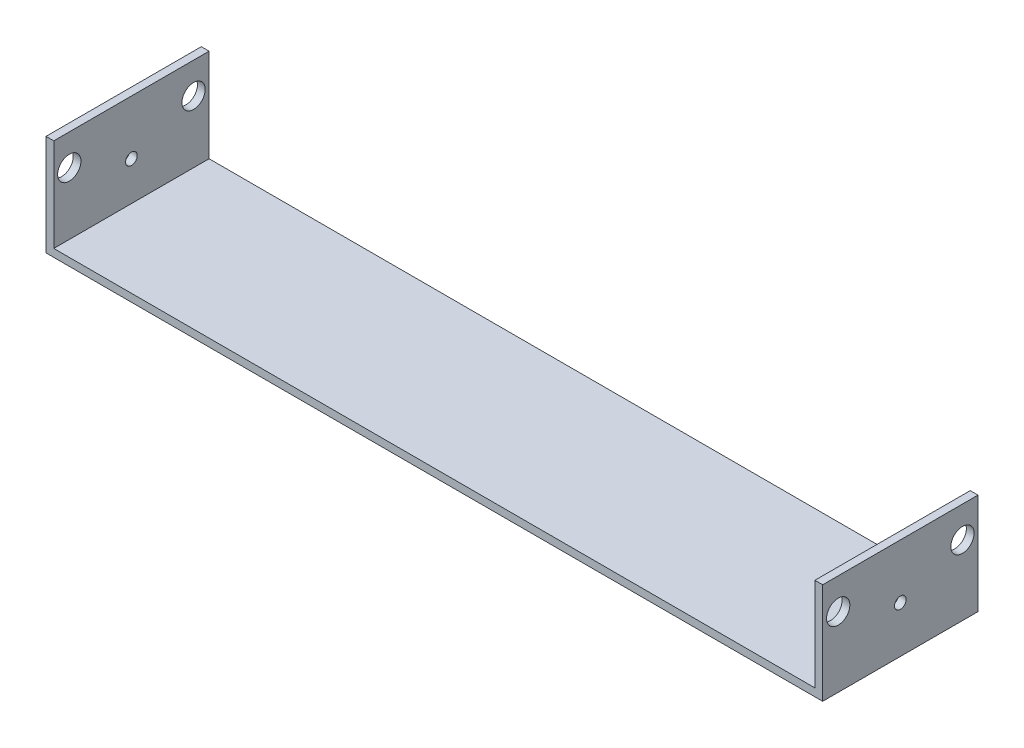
ISO-10303-21;
HEADER;
FILE_DESCRIPTION(('STEP AP214'),'2;1');
FILE_NAME('part.step','',(''),(''),'','','');
FILE_SCHEMA(('AUTOMOTIVE_DESIGN { 1 0 10303 214 1 1 1 1 }'));
ENDSEC;
DATA;
#1=APPLICATION_CONTEXT('core data for automotive mechanical design processes');
#2=APPLICATION_PROTOCOL_DEFINITION('international standard','automotive_design',2000,#1);
#3=PRODUCT_CONTEXT('',#1,'mechanical');
#4=PRODUCT('Part','Part','',(#3));
#5=PRODUCT_RELATED_PRODUCT_CATEGORY('part','',(#4));
#6=PRODUCT_DEFINITION_FORMATION('','',#4);
#7=PRODUCT_DEFINITION_CONTEXT('part definition',#1,'design');
#8=PRODUCT_DEFINITION('design','',#6,#7);
#9=PRODUCT_DEFINITION_SHAPE('','',#8);
#10=(LENGTH_UNIT() NAMED_UNIT(*) SI_UNIT(.MILLI.,.METRE.));
#11=(NAMED_UNIT(*) PLANE_ANGLE_UNIT() SI_UNIT($,.RADIAN.));
#12=(NAMED_UNIT(*) SI_UNIT($,.STERADIAN.) SOLID_ANGLE_UNIT());
#13=UNCERTAINTY_MEASURE_WITH_UNIT(LENGTH_MEASURE(1.E-05),#10,'distance_accuracy_value','');
#14=(GEOMETRIC_REPRESENTATION_CONTEXT(3) GLOBAL_UNCERTAINTY_ASSIGNED_CONTEXT((#13)) GLOBAL_UNIT_ASSIGNED_CONTEXT((#10,
#11,#12)) REPRESENTATION_CONTEXT('',''));
#15=CARTESIAN_POINT('',(0.,0.,0.));
#16=DIRECTION('',(0.,0.,1.));
#17=DIRECTION('',(1.,0.,0.));
#18=AXIS2_PLACEMENT_3D('',#15,#16,#17);
#19=CARTESIAN_POINT('',(-60.4331898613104,6.35,75.7878367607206));
#20=DIRECTION('',(0.,1.,0.));
#21=DIRECTION('',(0.,0.,1.));
#22=AXIS2_PLACEMENT_3D('',#19,#20,#21);
#23=PLANE('',#22);
#24=DIRECTION('',(-1.,0.,0.));
#25=VECTOR('',#24,1.);
#26=CARTESIAN_POINT('',(-60.4331898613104,6.35,-51.2121632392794));
#27=LINE('',#26,#25);
#28=CARTESIAN_POINT('',(568.216810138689,6.35,-51.2121632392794));
#29=VERTEX_POINT('',#28);
#30=CARTESIAN_POINT('',(-54.0831898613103,6.35,-51.2121632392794));
#31=VERTEX_POINT('',#30);
#32=EDGE_CURVE('E56',#29,#31,#27,.T.);
#33=ORIENTED_EDGE('',*,*,#32,.T.);
#34=DIRECTION('',(0.,0.,-1.));
#35=VECTOR('',#34,1.);
#36=CARTESIAN_POINT('',(-54.0831898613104,6.35,75.7878367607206));
#37=LINE('',#36,#35);
#38=CARTESIAN_POINT('',(-54.0831898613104,6.35,75.7878367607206));
#39=VERTEX_POINT('',#38);
#40=EDGE_CURVE('E51',#39,#31,#37,.T.);
#41=ORIENTED_EDGE('',*,*,#40,.F.);
#42=DIRECTION('',(1.,0.,0.));
#43=VECTOR('',#42,1.);
#44=CARTESIAN_POINT('',(-60.4331898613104,6.35,75.7878367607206));
#45=LINE('',#44,#43);
#46=CARTESIAN_POINT('',(568.21681013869,6.35,75.7878367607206));
#47=VERTEX_POINT('',#46);
#48=EDGE_CURVE('E151',#39,#47,#45,.T.);
#49=ORIENTED_EDGE('',*,*,#48,.T.);
#50=DIRECTION('',(0.,0.,1.));
#51=VECTOR('',#50,1.);
#52=CARTESIAN_POINT('',(568.21681013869,6.35,75.7878367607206));
#53=LINE('',#52,#51);
#54=EDGE_CURVE('E130',#29,#47,#53,.T.);
#55=ORIENTED_EDGE('',*,*,#54,.F.);
#56=EDGE_LOOP('',(#33,#41,#49,#55));
#57=FACE_BOUND('',#56,.T.);
#58=ADVANCED_FACE('F34',(#57),#23,.T.);
#59=CARTESIAN_POINT('',(-60.4331898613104,6.35,-51.2121632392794));
#60=DIRECTION('',(1.,0.,0.));
#61=DIRECTION('',(0.,0.,-1.));
#62=AXIS2_PLACEMENT_3D('',#59,#60,#61);
#63=PLANE('',#62);
#64=CARTESIAN_POINT('',(-60.4331898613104,38.1,12.2878367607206));
#65=DIRECTION('',(-1.,0.,0.));
#66=DIRECTION('',(0.,0.,1.));
#67=AXIS2_PLACEMENT_3D('',#64,#65,#66);
#68=CIRCLE('',#67,4.76250000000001);
#69=CARTESIAN_POINT('',(-60.4331898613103,38.1,17.0503367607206));
#70=VERTEX_POINT('',#69);
#71=EDGE_CURVE('E400',#70,#70,#68,.T.);
#72=ORIENTED_EDGE('',*,*,#71,.F.);
#73=EDGE_LOOP('',(#72));
#74=FACE_BOUND('',#73,.T.);
#75=CARTESIAN_POINT('',(-60.4331898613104,57.15,63.0878367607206));
#76=DIRECTION('',(-1.,0.,0.));
#77=DIRECTION('',(0.,0.,1.));
#78=AXIS2_PLACEMENT_3D('',#75,#76,#77);
#79=CIRCLE('',#78,9.52500000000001);
#80=CARTESIAN_POINT('',(-60.4331898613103,57.15,72.6128367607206));
#81=VERTEX_POINT('',#80);
#82=EDGE_CURVE('E361',#81,#81,#79,.T.);
#83=ORIENTED_EDGE('',*,*,#82,.F.);
#84=EDGE_LOOP('',(#83));
#85=FACE_BOUND('',#84,.T.);
#86=CARTESIAN_POINT('',(-60.4331898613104,57.15,-38.5121632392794));
#87=DIRECTION('',(-1.,0.,0.));
#88=DIRECTION('',(0.,0.,1.));
#89=AXIS2_PLACEMENT_3D('',#86,#87,#88);
#90=CIRCLE('',#89,9.525);
#91=CARTESIAN_POINT('',(-60.4331898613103,57.15,-28.9871632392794));
#92=VERTEX_POINT('',#91);
#93=EDGE_CURVE('E375',#92,#92,#90,.T.);
#94=ORIENTED_EDGE('',*,*,#93,.F.);
#95=EDGE_LOOP('',(#94));
#96=FACE_BOUND('',#95,.T.);
#97=DIRECTION('',(0.,0.,1.));
#98=VECTOR('',#97,1.);
#99=CARTESIAN_POINT('',(-60.4331898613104,0.,-51.2121632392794));
#100=LINE('',#99,#98);
#101=CARTESIAN_POINT('',(-60.4331898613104,0.,-51.2121632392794));
#102=VERTEX_POINT('',#101);
#103=CARTESIAN_POINT('',(-60.4331898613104,0.,75.7878367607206));
#104=VERTEX_POINT('',#103);
#105=EDGE_CURVE('E104',#102,#104,#100,.T.);
#106=ORIENTED_EDGE('',*,*,#105,.T.);
#107=DIRECTION('',(0.,-1.,0.));
#108=VECTOR('',#107,1.);
#109=CARTESIAN_POINT('',(-60.4331898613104,6.35,75.7878367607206));
#110=LINE('',#109,#108);
#111=CARTESIAN_POINT('',(-60.4331898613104,82.55,75.7878367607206));
#112=VERTEX_POINT('',#111);
#113=EDGE_CURVE('E11',#112,#104,#110,.T.);
#114=ORIENTED_EDGE('',*,*,#113,.F.);
#115=DIRECTION('',(0.,0.,1.));
#116=VECTOR('',#115,1.);
#117=CARTESIAN_POINT('',(-60.4331898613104,82.55,75.7878367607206));
#118=LINE('',#117,#116);
#119=CARTESIAN_POINT('',(-60.4331898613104,82.55,-51.2121632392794));
#120=VERTEX_POINT('',#119);
#121=EDGE_CURVE('E102',#120,#112,#118,.T.);
#122=ORIENTED_EDGE('',*,*,#121,.F.);
#123=DIRECTION('',(0.,-1.,0.));
#124=VECTOR('',#123,1.);
#125=CARTESIAN_POINT('',(-60.4331898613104,6.35,-51.2121632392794));
#126=LINE('',#125,#124);
#127=EDGE_CURVE('E161',#120,#102,#126,.T.);
#128=ORIENTED_EDGE('',*,*,#127,.T.);
#129=EDGE_LOOP('',(#106,#114,#122,#128));
#130=FACE_BOUND('',#129,.T.);
#131=ADVANCED_FACE('F36',(#74,#85,#96,#130),#63,.F.);
#132=CARTESIAN_POINT('',(-60.4331898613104,6.35,75.7878367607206));
#133=DIRECTION('',(0.,0.,-1.));
#134=DIRECTION('',(-1.,0.,0.));
#135=AXIS2_PLACEMENT_3D('',#132,#133,#134);
#136=PLANE('',#135);
#137=DIRECTION('',(1.,0.,0.));
#138=VECTOR('',#137,1.);
#139=CARTESIAN_POINT('',(-60.4331898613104,0.,75.7878367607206));
#140=LINE('',#139,#138);
#141=CARTESIAN_POINT('',(574.56681013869,0.,75.7878367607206));
#142=VERTEX_POINT('',#141);
#143=EDGE_CURVE('E178',#104,#142,#140,.T.);
#144=ORIENTED_EDGE('',*,*,#143,.T.);
#145=DIRECTION('',(0.,-1.,0.));
#146=VECTOR('',#145,1.);
#147=CARTESIAN_POINT('',(574.56681013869,6.35,75.7878367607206));
#148=LINE('',#147,#146);
#149=CARTESIAN_POINT('',(574.56681013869,82.55,75.7878367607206));
#150=VERTEX_POINT('',#149);
#151=EDGE_CURVE('E43',#150,#142,#148,.T.);
#152=ORIENTED_EDGE('',*,*,#151,.F.);
#153=DIRECTION('',(1.,0.,0.));
#154=VECTOR('',#153,1.);
#155=CARTESIAN_POINT('',(574.56681013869,82.55,75.7878367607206));
#156=LINE('',#155,#154);
#157=CARTESIAN_POINT('',(568.21681013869,82.55,75.7878367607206));
#158=VERTEX_POINT('',#157);
#159=EDGE_CURVE('E144',#158,#150,#156,.T.);
#160=ORIENTED_EDGE('',*,*,#159,.F.);
#161=DIRECTION('',(0.,-1.,0.));
#162=VECTOR('',#161,1.);
#163=CARTESIAN_POINT('',(568.21681013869,82.55,75.7878367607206));
#164=LINE('',#163,#162);
#165=EDGE_CURVE('E140',#158,#47,#164,.T.);
#166=ORIENTED_EDGE('',*,*,#165,.T.);
#167=ORIENTED_EDGE('',*,*,#48,.F.);
#168=DIRECTION('',(0.,-1.,0.));
#169=VECTOR('',#168,1.);
#170=CARTESIAN_POINT('',(-54.0831898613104,82.55,75.7878367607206));
#171=LINE('',#170,#169);
#172=CARTESIAN_POINT('',(-54.0831898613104,82.55,75.7878367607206));
#173=VERTEX_POINT('',#172);
#174=EDGE_CURVE('E110',#173,#39,#171,.T.);
#175=ORIENTED_EDGE('',*,*,#174,.F.);
#176=DIRECTION('',(1.,0.,0.));
#177=VECTOR('',#176,1.);
#178=CARTESIAN_POINT('',(-60.4331898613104,82.55,75.7878367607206));
#179=LINE('',#178,#177);
#180=EDGE_CURVE('E107',#112,#173,#179,.T.);
#181=ORIENTED_EDGE('',*,*,#180,.F.);
#182=ORIENTED_EDGE('',*,*,#113,.T.);
#183=EDGE_LOOP('',(#144,#152,#160,#166,#167,#175,#181,#182));
#184=FACE_BOUND('',#183,.T.);
#185=ADVANCED_FACE('F108',(#184),#136,.F.);
#186=CARTESIAN_POINT('',(574.56681013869,6.35,-51.2121632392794));
#187=DIRECTION('',(-1.,0.,0.));
#188=DIRECTION('',(0.,0.,1.));
#189=AXIS2_PLACEMENT_3D('',#186,#187,#188);
#190=PLANE('',#189);
#191=CARTESIAN_POINT('',(574.56681013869,38.1,12.2878367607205));
#192=DIRECTION('',(-1.,0.,0.));
#193=DIRECTION('',(0.,0.,1.));
#194=AXIS2_PLACEMENT_3D('',#191,#192,#193);
#195=CIRCLE('',#194,4.76250000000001);
#196=CARTESIAN_POINT('',(574.56681013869,38.1,17.0503367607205));
#197=VERTEX_POINT('',#196);
#198=EDGE_CURVE('E357',#197,#197,#195,.T.);
#199=ORIENTED_EDGE('',*,*,#198,.T.);
#200=EDGE_LOOP('',(#199));
#201=FACE_BOUND('',#200,.T.);
#202=CARTESIAN_POINT('',(574.56681013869,57.15,63.0878367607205));
#203=DIRECTION('',(-1.,0.,0.));
#204=DIRECTION('',(0.,0.,1.));
#205=AXIS2_PLACEMENT_3D('',#202,#203,#204);
#206=CIRCLE('',#205,9.52500000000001);
#207=CARTESIAN_POINT('',(574.56681013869,57.15,72.6128367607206));
#208=VERTEX_POINT('',#207);
#209=EDGE_CURVE('E364',#208,#208,#206,.T.);
#210=ORIENTED_EDGE('',*,*,#209,.T.);
#211=EDGE_LOOP('',(#210));
#212=FACE_BOUND('',#211,.T.);
#213=CARTESIAN_POINT('',(574.56681013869,57.15,-38.5121632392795));
#214=DIRECTION('',(-1.,0.,0.));
#215=DIRECTION('',(0.,0.,1.));
#216=AXIS2_PLACEMENT_3D('',#213,#214,#215);
#217=CIRCLE('',#216,9.525);
#218=CARTESIAN_POINT('',(574.56681013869,57.15,-28.9871632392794));
#219=VERTEX_POINT('',#218);
#220=EDGE_CURVE('E378',#219,#219,#217,.T.);
#221=ORIENTED_EDGE('',*,*,#220,.T.);
#222=EDGE_LOOP('',(#221));
#223=FACE_BOUND('',#222,.T.);
#224=DIRECTION('',(0.,0.,-1.));
#225=VECTOR('',#224,1.);
#226=CARTESIAN_POINT('',(574.56681013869,0.,-51.2121632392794));
#227=LINE('',#226,#225);
#228=CARTESIAN_POINT('',(574.56681013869,0.,-51.2121632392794));
#229=VERTEX_POINT('',#228);
#230=EDGE_CURVE('E171',#142,#229,#227,.T.);
#231=ORIENTED_EDGE('',*,*,#230,.T.);
#232=DIRECTION('',(0.,-1.,0.));
#233=VECTOR('',#232,1.);
#234=CARTESIAN_POINT('',(574.56681013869,6.35,-51.2121632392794));
#235=LINE('',#234,#233);
#236=CARTESIAN_POINT('',(574.56681013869,82.55,-51.2121632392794));
#237=VERTEX_POINT('',#236);
#238=EDGE_CURVE('E163',#237,#229,#235,.T.);
#239=ORIENTED_EDGE('',*,*,#238,.F.);
#240=DIRECTION('',(0.,0.,-1.));
#241=VECTOR('',#240,1.);
#242=CARTESIAN_POINT('',(574.56681013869,82.55,75.7878367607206));
#243=LINE('',#242,#241);
#244=EDGE_CURVE('E133',#150,#237,#243,.T.);
#245=ORIENTED_EDGE('',*,*,#244,.F.);
#246=ORIENTED_EDGE('',*,*,#151,.T.);
#247=EDGE_LOOP('',(#231,#239,#245,#246));
#248=FACE_BOUND('',#247,.T.);
#249=ADVANCED_FACE('F170',(#201,#212,#223,#248),#190,.F.);
#250=CARTESIAN_POINT('',(-60.4331898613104,6.35,-51.2121632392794));
#251=DIRECTION('',(0.,0.,1.));
#252=DIRECTION('',(1.,0.,0.));
#253=AXIS2_PLACEMENT_3D('',#250,#251,#252);
#254=PLANE('',#253);
#255=DIRECTION('',(-1.,0.,0.));
#256=VECTOR('',#255,1.);
#257=CARTESIAN_POINT('',(-60.4331898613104,0.,-51.2121632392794));
#258=LINE('',#257,#256);
#259=EDGE_CURVE('E154',#229,#102,#258,.T.);
#260=ORIENTED_EDGE('',*,*,#259,.T.);
#261=ORIENTED_EDGE('',*,*,#127,.F.);
#262=DIRECTION('',(-1.,0.,0.));
#263=VECTOR('',#262,1.);
#264=CARTESIAN_POINT('',(-60.4331898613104,82.55,-51.2121632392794));
#265=LINE('',#264,#263);
#266=CARTESIAN_POINT('',(-54.0831898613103,82.55,-51.2121632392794));
#267=VERTEX_POINT('',#266);
#268=EDGE_CURVE('E118',#267,#120,#265,.T.);
#269=ORIENTED_EDGE('',*,*,#268,.F.);
#270=DIRECTION('',(0.,-1.,0.));
#271=VECTOR('',#270,1.);
#272=CARTESIAN_POINT('',(-54.0831898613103,82.55,-51.2121632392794));
#273=LINE('',#272,#271);
#274=EDGE_CURVE('E126',#267,#31,#273,.T.);
#275=ORIENTED_EDGE('',*,*,#274,.T.);
#276=ORIENTED_EDGE('',*,*,#32,.F.);
#277=DIRECTION('',(0.,-1.,0.));
#278=VECTOR('',#277,1.);
#279=CARTESIAN_POINT('',(568.21681013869,82.55,-51.2121632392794));
#280=LINE('',#279,#278);
#281=CARTESIAN_POINT('',(568.21681013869,82.55,-51.2121632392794));
#282=VERTEX_POINT('',#281);
#283=EDGE_CURVE('E143',#282,#29,#280,.T.);
#284=ORIENTED_EDGE('',*,*,#283,.F.);
#285=DIRECTION('',(-1.,0.,0.));
#286=VECTOR('',#285,1.);
#287=CARTESIAN_POINT('',(574.56681013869,82.55,-51.2121632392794));
#288=LINE('',#287,#286);
#289=EDGE_CURVE('E184',#237,#282,#288,.T.);
#290=ORIENTED_EDGE('',*,*,#289,.F.);
#291=ORIENTED_EDGE('',*,*,#238,.T.);
#292=EDGE_LOOP('',(#260,#261,#269,#275,#276,#284,#290,#291));
#293=FACE_BOUND('',#292,.T.);
#294=ADVANCED_FACE('F194',(#293),#254,.F.);
#295=CARTESIAN_POINT('',(-60.4331898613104,0.,75.7878367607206));
#296=DIRECTION('',(0.,1.,0.));
#297=DIRECTION('',(0.,0.,1.));
#298=AXIS2_PLACEMENT_3D('',#295,#296,#297);
#299=PLANE('',#298);
#300=ORIENTED_EDGE('',*,*,#105,.F.);
#301=ORIENTED_EDGE('',*,*,#259,.F.);
#302=ORIENTED_EDGE('',*,*,#230,.F.);
#303=ORIENTED_EDGE('',*,*,#143,.F.);
#304=EDGE_LOOP('',(#300,#301,#302,#303));
#305=FACE_BOUND('',#304,.T.);
#306=ADVANCED_FACE('F177',(#305),#299,.F.);
#307=CARTESIAN_POINT('',(568.21681013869,82.55,75.7878367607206));
#308=DIRECTION('',(1.,0.,0.));
#309=DIRECTION('',(0.,0.,-1.));
#310=AXIS2_PLACEMENT_3D('',#307,#308,#309);
#311=PLANE('',#310);
#312=CARTESIAN_POINT('',(568.21681013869,38.1,12.2878367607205));
#313=DIRECTION('',(1.,0.,0.));
#314=DIRECTION('',(0.,0.,-1.));
#315=AXIS2_PLACEMENT_3D('',#312,#313,#314);
#316=CIRCLE('',#315,4.76250000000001);
#317=CARTESIAN_POINT('',(568.21681013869,38.1,17.0503367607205));
#318=VERTEX_POINT('',#317);
#319=EDGE_CURVE('E360',#318,#318,#316,.T.);
#320=ORIENTED_EDGE('',*,*,#319,.T.);
#321=EDGE_LOOP('',(#320));
#322=FACE_BOUND('',#321,.T.);
#323=CARTESIAN_POINT('',(568.21681013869,57.15,63.0878367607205));
#324=DIRECTION('',(1.,0.,0.));
#325=DIRECTION('',(0.,0.,-1.));
#326=AXIS2_PLACEMENT_3D('',#323,#324,#325);
#327=CIRCLE('',#326,9.52500000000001);
#328=CARTESIAN_POINT('',(568.21681013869,57.15,72.6128367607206));
#329=VERTEX_POINT('',#328);
#330=EDGE_CURVE('E372',#329,#329,#327,.T.);
#331=ORIENTED_EDGE('',*,*,#330,.T.);
#332=EDGE_LOOP('',(#331));
#333=FACE_BOUND('',#332,.T.);
#334=CARTESIAN_POINT('',(568.21681013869,57.15,-38.5121632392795));
#335=DIRECTION('',(1.,0.,0.));
#336=DIRECTION('',(0.,0.,-1.));
#337=AXIS2_PLACEMENT_3D('',#334,#335,#336);
#338=CIRCLE('',#337,9.525);
#339=CARTESIAN_POINT('',(568.21681013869,57.15,-28.9871632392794));
#340=VERTEX_POINT('',#339);
#341=EDGE_CURVE('E120',#340,#340,#338,.T.);
#342=ORIENTED_EDGE('',*,*,#341,.T.);
#343=EDGE_LOOP('',(#342));
#344=FACE_BOUND('',#343,.T.);
#345=ORIENTED_EDGE('',*,*,#54,.T.);
#346=ORIENTED_EDGE('',*,*,#165,.F.);
#347=DIRECTION('',(0.,0.,1.));
#348=VECTOR('',#347,1.);
#349=CARTESIAN_POINT('',(568.21681013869,82.55,75.7878367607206));
#350=LINE('',#349,#348);
#351=EDGE_CURVE('E183',#282,#158,#350,.T.);
#352=ORIENTED_EDGE('',*,*,#351,.F.);
#353=ORIENTED_EDGE('',*,*,#283,.T.);
#354=EDGE_LOOP('',(#345,#346,#352,#353));
#355=FACE_BOUND('',#354,.T.);
#356=ADVANCED_FACE('F192',(#322,#333,#344,#355),#311,.F.);
#357=CARTESIAN_POINT('',(574.56681013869,82.55,-51.2121632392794));
#358=DIRECTION('',(0.,1.,0.));
#359=DIRECTION('',(0.,0.,1.));
#360=AXIS2_PLACEMENT_3D('',#357,#358,#359);
#361=PLANE('',#360);
#362=ORIENTED_EDGE('',*,*,#244,.T.);
#363=ORIENTED_EDGE('',*,*,#289,.T.);
#364=ORIENTED_EDGE('',*,*,#351,.T.);
#365=ORIENTED_EDGE('',*,*,#159,.T.);
#366=EDGE_LOOP('',(#362,#363,#364,#365));
#367=FACE_BOUND('',#366,.T.);
#368=ADVANCED_FACE('F188',(#367),#361,.T.);
#369=CARTESIAN_POINT('',(-54.0831898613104,82.55,75.7878367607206));
#370=DIRECTION('',(-1.,0.,0.));
#371=DIRECTION('',(0.,0.,1.));
#372=AXIS2_PLACEMENT_3D('',#369,#370,#371);
#373=PLANE('',#372);
#374=CARTESIAN_POINT('',(-54.0831898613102,38.1,12.2878367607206));
#375=DIRECTION('',(-1.,0.,0.));
#376=DIRECTION('',(0.,0.,1.));
#377=AXIS2_PLACEMENT_3D('',#374,#375,#376);
#378=CIRCLE('',#377,4.76250000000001);
#379=CARTESIAN_POINT('',(-54.0831898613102,38.1,17.0503367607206));
#380=VERTEX_POINT('',#379);
#381=EDGE_CURVE('E38',#380,#380,#378,.T.);
#382=ORIENTED_EDGE('',*,*,#381,.T.);
#383=EDGE_LOOP('',(#382));
#384=FACE_BOUND('',#383,.T.);
#385=CARTESIAN_POINT('',(-54.0831898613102,57.15,63.0878367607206));
#386=DIRECTION('',(-1.,0.,0.));
#387=DIRECTION('',(0.,0.,1.));
#388=AXIS2_PLACEMENT_3D('',#385,#386,#387);
#389=CIRCLE('',#388,9.52500000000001);
#390=CARTESIAN_POINT('',(-54.0831898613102,57.15,72.6128367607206));
#391=VERTEX_POINT('',#390);
#392=EDGE_CURVE('E371',#391,#391,#389,.T.);
#393=ORIENTED_EDGE('',*,*,#392,.T.);
#394=EDGE_LOOP('',(#393));
#395=FACE_BOUND('',#394,.T.);
#396=CARTESIAN_POINT('',(-54.0831898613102,57.15,-38.5121632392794));
#397=DIRECTION('',(-1.,0.,0.));
#398=DIRECTION('',(0.,0.,1.));
#399=AXIS2_PLACEMENT_3D('',#396,#397,#398);
#400=CIRCLE('',#399,9.525);
#401=CARTESIAN_POINT('',(-54.0831898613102,57.15,-28.9871632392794));
#402=VERTEX_POINT('',#401);
#403=EDGE_CURVE('E155',#402,#402,#400,.T.);
#404=ORIENTED_EDGE('',*,*,#403,.T.);
#405=EDGE_LOOP('',(#404));
#406=FACE_BOUND('',#405,.T.);
#407=ORIENTED_EDGE('',*,*,#40,.T.);
#408=ORIENTED_EDGE('',*,*,#274,.F.);
#409=DIRECTION('',(0.,0.,-1.));
#410=VECTOR('',#409,1.);
#411=CARTESIAN_POINT('',(-54.0831898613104,82.55,75.7878367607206));
#412=LINE('',#411,#410);
#413=EDGE_CURVE('E113',#173,#267,#412,.T.);
#414=ORIENTED_EDGE('',*,*,#413,.F.);
#415=ORIENTED_EDGE('',*,*,#174,.T.);
#416=EDGE_LOOP('',(#407,#408,#414,#415));
#417=FACE_BOUND('',#416,.T.);
#418=ADVANCED_FACE('F197',(#384,#395,#406,#417),#373,.F.);
#419=CARTESIAN_POINT('',(-60.4331898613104,82.55,-51.2121632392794));
#420=DIRECTION('',(0.,-1.,0.));
#421=DIRECTION('',(0.,0.,-1.));
#422=AXIS2_PLACEMENT_3D('',#419,#420,#421);
#423=PLANE('',#422);
#424=ORIENTED_EDGE('',*,*,#121,.T.);
#425=ORIENTED_EDGE('',*,*,#180,.T.);
#426=ORIENTED_EDGE('',*,*,#413,.T.);
#427=ORIENTED_EDGE('',*,*,#268,.T.);
#428=EDGE_LOOP('',(#424,#425,#426,#427));
#429=FACE_BOUND('',#428,.T.);
#430=ADVANCED_FACE('F116',(#429),#423,.F.);
#431=CARTESIAN_POINT('',(574.56681013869,57.15,-38.5121632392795));
#432=DIRECTION('',(-1.,0.,0.));
#433=DIRECTION('',(0.,0.,1.));
#434=AXIS2_PLACEMENT_3D('',#431,#432,#433);
#435=CYLINDRICAL_SURFACE('',#434,9.525);
#436=CARTESIAN_POINT('',(-60.4331898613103,57.15,-28.9871632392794));
#437=CARTESIAN_POINT('',(-60.367044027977,57.15,-28.9871632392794));
#438=CARTESIAN_POINT('',(-60.3008981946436,57.15,-28.9871632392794));
#439=CARTESIAN_POINT('',(-60.168606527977,57.15,-28.9871632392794));
#440=CARTESIAN_POINT('',(-60.1024606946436,57.15,-28.9871632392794));
#441=CARTESIAN_POINT('',(-59.970169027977,57.15,-28.9871632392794));
#442=CARTESIAN_POINT('',(-59.9040231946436,57.15,-28.9871632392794));
#443=CARTESIAN_POINT('',(-59.771731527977,57.15,-28.9871632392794));
#444=CARTESIAN_POINT('',(-59.7055856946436,57.15,-28.9871632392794));
#445=CARTESIAN_POINT('',(-59.573294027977,57.15,-28.9871632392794));
#446=CARTESIAN_POINT('',(-59.5071481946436,57.15,-28.9871632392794));
#447=CARTESIAN_POINT('',(-59.374856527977,57.15,-28.9871632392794));
#448=CARTESIAN_POINT('',(-59.3087106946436,57.15,-28.9871632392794));
#449=CARTESIAN_POINT('',(-59.176419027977,57.15,-28.9871632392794));
#450=CARTESIAN_POINT('',(-59.1102731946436,57.15,-28.9871632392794));
#451=CARTESIAN_POINT('',(-58.9779815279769,57.15,-28.9871632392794));
#452=CARTESIAN_POINT('',(-58.9118356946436,57.15,-28.9871632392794));
#453=CARTESIAN_POINT('',(-58.7795440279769,57.15,-28.9871632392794));
#454=CARTESIAN_POINT('',(-58.7133981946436,57.15,-28.9871632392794));
#455=CARTESIAN_POINT('',(-58.581106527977,57.15,-28.9871632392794));
#456=CARTESIAN_POINT('',(-58.5149606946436,57.15,-28.9871632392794));
#457=CARTESIAN_POINT('',(-58.3826690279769,57.15,-28.9871632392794));
#458=CARTESIAN_POINT('',(-58.3165231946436,57.15,-28.9871632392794));
#459=CARTESIAN_POINT('',(-58.1842315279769,57.15,-28.9871632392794));
#460=CARTESIAN_POINT('',(-58.1180856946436,57.15,-28.9871632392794));
#461=CARTESIAN_POINT('',(-57.985794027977,57.15,-28.9871632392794));
#462=CARTESIAN_POINT('',(-57.9196481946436,57.15,-28.9871632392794));
#463=CARTESIAN_POINT('',(-57.7873565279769,57.15,-28.9871632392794));
#464=CARTESIAN_POINT('',(-57.7212106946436,57.15,-28.9871632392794));
#465=CARTESIAN_POINT('',(-57.5889190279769,57.15,-28.9871632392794));
#466=CARTESIAN_POINT('',(-57.5227731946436,57.15,-28.9871632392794));
#467=CARTESIAN_POINT('',(-57.390481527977,57.15,-28.9871632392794));
#468=CARTESIAN_POINT('',(-57.3243356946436,57.15,-28.9871632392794));
#469=CARTESIAN_POINT('',(-57.1920440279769,57.15,-28.9871632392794));
#470=CARTESIAN_POINT('',(-57.1258981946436,57.15,-28.9871632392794));
#471=CARTESIAN_POINT('',(-56.9936065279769,57.15,-28.9871632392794));
#472=CARTESIAN_POINT('',(-56.9274606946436,57.15,-28.9871632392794));
#473=CARTESIAN_POINT('',(-56.795169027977,57.15,-28.9871632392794));
#474=CARTESIAN_POINT('',(-56.7290231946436,57.15,-28.9871632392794));
#475=CARTESIAN_POINT('',(-56.5967315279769,57.15,-28.9871632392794));
#476=CARTESIAN_POINT('',(-56.5305856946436,57.15,-28.9871632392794));
#477=CARTESIAN_POINT('',(-56.3982940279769,57.15,-28.9871632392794));
#478=CARTESIAN_POINT('',(-56.3321481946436,57.15,-28.9871632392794));
#479=CARTESIAN_POINT('',(-56.199856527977,57.15,-28.9871632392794));
#480=CARTESIAN_POINT('',(-56.1337106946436,57.15,-28.9871632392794));
#481=CARTESIAN_POINT('',(-56.0014190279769,57.15,-28.9871632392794));
#482=CARTESIAN_POINT('',(-55.9352731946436,57.15,-28.9871632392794));
#483=CARTESIAN_POINT('',(-55.8029815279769,57.15,-28.9871632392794));
#484=CARTESIAN_POINT('',(-55.7368356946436,57.15,-28.9871632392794));
#485=CARTESIAN_POINT('',(-55.6045440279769,57.15,-28.9871632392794));
#486=CARTESIAN_POINT('',(-55.5383981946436,57.15,-28.9871632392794));
#487=CARTESIAN_POINT('',(-55.4061065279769,57.15,-28.9871632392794));
#488=CARTESIAN_POINT('',(-55.3399606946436,57.15,-28.9871632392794));
#489=CARTESIAN_POINT('',(-55.2076690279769,57.15,-28.9871632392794));
#490=CARTESIAN_POINT('',(-55.1415231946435,57.15,-28.9871632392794));
#491=CARTESIAN_POINT('',(-55.0092315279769,57.15,-28.9871632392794));
#492=CARTESIAN_POINT('',(-54.9430856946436,57.15,-28.9871632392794));
#493=CARTESIAN_POINT('',(-54.8107940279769,57.15,-28.9871632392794));
#494=CARTESIAN_POINT('',(-54.7446481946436,57.15,-28.9871632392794));
#495=CARTESIAN_POINT('',(-54.6123565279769,57.15,-28.9871632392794));
#496=CARTESIAN_POINT('',(-54.5462106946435,57.15,-28.9871632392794));
#497=CARTESIAN_POINT('',(-54.4139190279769,57.15,-28.9871632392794));
#498=CARTESIAN_POINT('',(-54.3477731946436,57.15,-28.9871632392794));
#499=CARTESIAN_POINT('',(-54.2154815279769,57.15,-28.9871632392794));
#500=CARTESIAN_POINT('',(-54.1493356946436,57.15,-28.9871632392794));
#501=CARTESIAN_POINT('',(-54.0831898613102,57.15,-28.9871632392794));
#502=B_SPLINE_CURVE_WITH_KNOTS('',3,(#436,#437,#438,#439,#440,#441,#442,#443,#444,#445,#446,
#447,#448,#449,#450,#451,#452,#453,#454,#455,#456,#457,#458,#459,#460,#461,#462,#463,#464,#465,
#466,#467,#468,#469,#470,#471,#472,#473,#474,#475,#476,#477,#478,#479,#480,#481,#482,#483,#484,
#485,#486,#487,#488,#489,#490,#491,#492,#493,#494,#495,#496,#497,#498,#499,#500,#501),
.UNSPECIFIED.,.F.,.F.,(4,2,2,2,2,2,2,2,2,2,2,2,2,2,2,2,2,2,2,2,2,2,2,2,2,2,2,2,2,2,2,2,4),(0.,
0.198437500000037,0.396874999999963,0.5953125,0.793750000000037,0.992187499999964,1.190625,
1.38906250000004,1.58750000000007,1.7859375,1.98437500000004,2.18281250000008,2.38125,
2.57968750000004,2.77812500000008,2.9765625,3.17500000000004,3.37343750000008,3.571875,
3.77031250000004,3.96875000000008,4.1671875,4.36562500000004,4.56406250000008,4.7625,
4.96093750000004,5.15937500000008,5.35781250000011,5.55625000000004,5.75468750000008,
5.95312500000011,6.15156250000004,6.35000000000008),.UNSPECIFIED.);
#503=EDGE_CURVE('BSEAM205',#92,#402,#502,.T.);
#504=ORIENTED_EDGE('',*,*,#93,.T.);
#505=ORIENTED_EDGE('',*,*,#403,.F.);
#506=ORIENTED_EDGE('',*,*,#503,.T.);
#507=ORIENTED_EDGE('',*,*,#503,.F.);
#508=EDGE_LOOP('',(#504,#506,#505,#507));
#509=FACE_BOUND('',#508,.T.);
#510=ADVANCED_FACE('F205',(#509),#435,.F.);
#511=CARTESIAN_POINT('',(574.56681013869,57.15,-28.9871632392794));
#512=CARTESIAN_POINT('',(574.500664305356,57.15,-28.9871632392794));
#513=CARTESIAN_POINT('',(574.434518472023,57.15,-28.9871632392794));
#514=CARTESIAN_POINT('',(574.302226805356,57.15,-28.9871632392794));
#515=CARTESIAN_POINT('',(574.236080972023,57.15,-28.9871632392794));
#516=CARTESIAN_POINT('',(574.103789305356,57.15,-28.9871632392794));
#517=CARTESIAN_POINT('',(574.037643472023,57.15,-28.9871632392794));
#518=CARTESIAN_POINT('',(573.905351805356,57.15,-28.9871632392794));
#519=CARTESIAN_POINT('',(573.839205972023,57.15,-28.9871632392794));
#520=CARTESIAN_POINT('',(573.706914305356,57.15,-28.9871632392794));
#521=CARTESIAN_POINT('',(573.640768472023,57.15,-28.9871632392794));
#522=CARTESIAN_POINT('',(573.508476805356,57.15,-28.9871632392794));
#523=CARTESIAN_POINT('',(573.442330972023,57.15,-28.9871632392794));
#524=CARTESIAN_POINT('',(573.310039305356,57.15,-28.9871632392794));
#525=CARTESIAN_POINT('',(573.243893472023,57.15,-28.9871632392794));
#526=CARTESIAN_POINT('',(573.111601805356,57.15,-28.9871632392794));
#527=CARTESIAN_POINT('',(573.045455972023,57.15,-28.9871632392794));
#528=CARTESIAN_POINT('',(572.913164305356,57.15,-28.9871632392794));
#529=CARTESIAN_POINT('',(572.847018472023,57.15,-28.9871632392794));
#530=CARTESIAN_POINT('',(572.714726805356,57.15,-28.9871632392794));
#531=CARTESIAN_POINT('',(572.648580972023,57.15,-28.9871632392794));
#532=CARTESIAN_POINT('',(572.516289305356,57.15,-28.9871632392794));
#533=CARTESIAN_POINT('',(572.450143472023,57.15,-28.9871632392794));
#534=CARTESIAN_POINT('',(572.317851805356,57.15,-28.9871632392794));
#535=CARTESIAN_POINT('',(572.251705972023,57.15,-28.9871632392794));
#536=CARTESIAN_POINT('',(572.119414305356,57.15,-28.9871632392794));
#537=CARTESIAN_POINT('',(572.053268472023,57.15,-28.9871632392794));
#538=CARTESIAN_POINT('',(571.920976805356,57.15,-28.9871632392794));
#539=CARTESIAN_POINT('',(571.854830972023,57.15,-28.9871632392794));
#540=CARTESIAN_POINT('',(571.722539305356,57.15,-28.9871632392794));
#541=CARTESIAN_POINT('',(571.656393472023,57.15,-28.9871632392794));
#542=CARTESIAN_POINT('',(571.524101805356,57.15,-28.9871632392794));
#543=CARTESIAN_POINT('',(571.457955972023,57.15,-28.9871632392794));
#544=CARTESIAN_POINT('',(571.325664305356,57.15,-28.9871632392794));
#545=CARTESIAN_POINT('',(571.259518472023,57.15,-28.9871632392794));
#546=CARTESIAN_POINT('',(571.127226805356,57.15,-28.9871632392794));
#547=CARTESIAN_POINT('',(571.061080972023,57.15,-28.9871632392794));
#548=CARTESIAN_POINT('',(570.928789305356,57.15,-28.9871632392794));
#549=CARTESIAN_POINT('',(570.862643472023,57.15,-28.9871632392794));
#550=CARTESIAN_POINT('',(570.730351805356,57.15,-28.9871632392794));
#551=CARTESIAN_POINT('',(570.664205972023,57.15,-28.9871632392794));
#552=CARTESIAN_POINT('',(570.531914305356,57.15,-28.9871632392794));
#553=CARTESIAN_POINT('',(570.465768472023,57.15,-28.9871632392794));
#554=CARTESIAN_POINT('',(570.333476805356,57.15,-28.9871632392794));
#555=CARTESIAN_POINT('',(570.267330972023,57.15,-28.9871632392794));
#556=CARTESIAN_POINT('',(570.135039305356,57.15,-28.9871632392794));
#557=CARTESIAN_POINT('',(570.068893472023,57.15,-28.9871632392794));
#558=CARTESIAN_POINT('',(569.936601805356,57.15,-28.9871632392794));
#559=CARTESIAN_POINT('',(569.870455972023,57.15,-28.9871632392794));
#560=CARTESIAN_POINT('',(569.738164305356,57.15,-28.9871632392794));
#561=CARTESIAN_POINT('',(569.672018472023,57.15,-28.9871632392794));
#562=CARTESIAN_POINT('',(569.539726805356,57.15,-28.9871632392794));
#563=CARTESIAN_POINT('',(569.473580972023,57.15,-28.9871632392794));
#564=CARTESIAN_POINT('',(569.341289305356,57.15,-28.9871632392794));
#565=CARTESIAN_POINT('',(569.275143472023,57.15,-28.9871632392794));
#566=CARTESIAN_POINT('',(569.142851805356,57.15,-28.9871632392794));
#567=CARTESIAN_POINT('',(569.076705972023,57.15,-28.9871632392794));
#568=CARTESIAN_POINT('',(568.944414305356,57.15,-28.9871632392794));
#569=CARTESIAN_POINT('',(568.878268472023,57.15,-28.9871632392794));
#570=CARTESIAN_POINT('',(568.745976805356,57.15,-28.9871632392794));
#571=CARTESIAN_POINT('',(568.679830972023,57.15,-28.9871632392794));
#572=CARTESIAN_POINT('',(568.547539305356,57.15,-28.9871632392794));
#573=CARTESIAN_POINT('',(568.481393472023,57.15,-28.9871632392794));
#574=CARTESIAN_POINT('',(568.349101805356,57.15,-28.9871632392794));
#575=CARTESIAN_POINT('',(568.282955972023,57.15,-28.9871632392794));
#576=CARTESIAN_POINT('',(568.21681013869,57.15,-28.9871632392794));
#577=B_SPLINE_CURVE_WITH_KNOTS('',3,(#511,#512,#513,#514,#515,#516,#517,#518,#519,#520,#521,
#522,#523,#524,#525,#526,#527,#528,#529,#530,#531,#532,#533,#534,#535,#536,#537,#538,#539,#540,
#541,#542,#543,#544,#545,#546,#547,#548,#549,#550,#551,#552,#553,#554,#555,#556,#557,#558,#559,
#560,#561,#562,#563,#564,#565,#566,#567,#568,#569,#570,#571,#572,#573,#574,#575,#576),
.UNSPECIFIED.,.F.,.F.,(4,2,2,2,2,2,2,2,2,2,2,2,2,2,2,2,2,2,2,2,2,2,2,2,2,2,2,2,2,2,2,2,4),(0.,
0.198437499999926,0.396874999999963,0.5953125,0.793749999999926,0.992187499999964,1.190625,
1.38906249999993,1.58749999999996,1.7859375,1.98437499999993,2.18281249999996,2.38125,
2.57968749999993,2.77812499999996,2.9765625,3.17499999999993,3.37343749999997,3.571875,
3.77031250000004,3.96874999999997,4.1671875,4.36562500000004,4.56406249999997,4.7625,
4.96093750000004,5.15937499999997,5.3578125,5.55625000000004,5.75468749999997,5.953125,
6.15156250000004,6.34999999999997),.UNSPECIFIED.);
#578=EDGE_CURVE('BSEAM267',#219,#340,#577,.T.);
#579=ORIENTED_EDGE('',*,*,#220,.F.);
#580=ORIENTED_EDGE('',*,*,#341,.F.);
#581=ORIENTED_EDGE('',*,*,#578,.T.);
#582=ORIENTED_EDGE('',*,*,#578,.F.);
#583=EDGE_LOOP('',(#579,#581,#580,#582));
#584=FACE_BOUND('',#583,.T.);
#585=ADVANCED_FACE('F267',(#584),#435,.F.);
#586=CARTESIAN_POINT('',(574.56681013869,57.15,63.0878367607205));
#587=DIRECTION('',(-1.,0.,0.));
#588=DIRECTION('',(0.,0.,1.));
#589=AXIS2_PLACEMENT_3D('',#586,#587,#588);
#590=CYLINDRICAL_SURFACE('',#589,9.52500000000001);
#591=CARTESIAN_POINT('',(-60.4331898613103,57.15,72.6128367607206));
#592=CARTESIAN_POINT('',(-60.367044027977,57.15,72.6128367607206));
#593=CARTESIAN_POINT('',(-60.3008981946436,57.15,72.6128367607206));
#594=CARTESIAN_POINT('',(-60.168606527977,57.15,72.6128367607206));
#595=CARTESIAN_POINT('',(-60.1024606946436,57.15,72.6128367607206));
#596=CARTESIAN_POINT('',(-59.970169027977,57.15,72.6128367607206));
#597=CARTESIAN_POINT('',(-59.9040231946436,57.15,72.6128367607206));
#598=CARTESIAN_POINT('',(-59.771731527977,57.15,72.6128367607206));
#599=CARTESIAN_POINT('',(-59.7055856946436,57.15,72.6128367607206));
#600=CARTESIAN_POINT('',(-59.573294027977,57.15,72.6128367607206));
#601=CARTESIAN_POINT('',(-59.5071481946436,57.15,72.6128367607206));
#602=CARTESIAN_POINT('',(-59.374856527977,57.15,72.6128367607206));
#603=CARTESIAN_POINT('',(-59.3087106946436,57.15,72.6128367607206));
#604=CARTESIAN_POINT('',(-59.176419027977,57.15,72.6128367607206));
#605=CARTESIAN_POINT('',(-59.1102731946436,57.15,72.6128367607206));
#606=CARTESIAN_POINT('',(-58.9779815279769,57.15,72.6128367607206));
#607=CARTESIAN_POINT('',(-58.9118356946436,57.15,72.6128367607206));
#608=CARTESIAN_POINT('',(-58.7795440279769,57.15,72.6128367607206));
#609=CARTESIAN_POINT('',(-58.7133981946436,57.15,72.6128367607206));
#610=CARTESIAN_POINT('',(-58.581106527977,57.15,72.6128367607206));
#611=CARTESIAN_POINT('',(-58.5149606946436,57.15,72.6128367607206));
#612=CARTESIAN_POINT('',(-58.3826690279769,57.15,72.6128367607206));
#613=CARTESIAN_POINT('',(-58.3165231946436,57.15,72.6128367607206));
#614=CARTESIAN_POINT('',(-58.1842315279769,57.15,72.6128367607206));
#615=CARTESIAN_POINT('',(-58.1180856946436,57.15,72.6128367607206));
#616=CARTESIAN_POINT('',(-57.985794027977,57.15,72.6128367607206));
#617=CARTESIAN_POINT('',(-57.9196481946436,57.15,72.6128367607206));
#618=CARTESIAN_POINT('',(-57.7873565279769,57.15,72.6128367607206));
#619=CARTESIAN_POINT('',(-57.7212106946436,57.15,72.6128367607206));
#620=CARTESIAN_POINT('',(-57.5889190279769,57.15,72.6128367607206));
#621=CARTESIAN_POINT('',(-57.5227731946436,57.15,72.6128367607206));
#622=CARTESIAN_POINT('',(-57.390481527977,57.15,72.6128367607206));
#623=CARTESIAN_POINT('',(-57.3243356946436,57.15,72.6128367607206));
#624=CARTESIAN_POINT('',(-57.1920440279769,57.15,72.6128367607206));
#625=CARTESIAN_POINT('',(-57.1258981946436,57.15,72.6128367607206));
#626=CARTESIAN_POINT('',(-56.9936065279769,57.15,72.6128367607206));
#627=CARTESIAN_POINT('',(-56.9274606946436,57.15,72.6128367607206));
#628=CARTESIAN_POINT('',(-56.795169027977,57.15,72.6128367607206));
#629=CARTESIAN_POINT('',(-56.7290231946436,57.15,72.6128367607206));
#630=CARTESIAN_POINT('',(-56.5967315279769,57.15,72.6128367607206));
#631=CARTESIAN_POINT('',(-56.5305856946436,57.15,72.6128367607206));
#632=CARTESIAN_POINT('',(-56.3982940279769,57.15,72.6128367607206));
#633=CARTESIAN_POINT('',(-56.3321481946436,57.15,72.6128367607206));
#634=CARTESIAN_POINT('',(-56.199856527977,57.15,72.6128367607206));
#635=CARTESIAN_POINT('',(-56.1337106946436,57.15,72.6128367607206));
#636=CARTESIAN_POINT('',(-56.0014190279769,57.15,72.6128367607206));
#637=CARTESIAN_POINT('',(-55.9352731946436,57.15,72.6128367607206));
#638=CARTESIAN_POINT('',(-55.8029815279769,57.15,72.6128367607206));
#639=CARTESIAN_POINT('',(-55.7368356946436,57.15,72.6128367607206));
#640=CARTESIAN_POINT('',(-55.6045440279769,57.15,72.6128367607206));
#641=CARTESIAN_POINT('',(-55.5383981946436,57.15,72.6128367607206));
#642=CARTESIAN_POINT('',(-55.4061065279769,57.15,72.6128367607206));
#643=CARTESIAN_POINT('',(-55.3399606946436,57.15,72.6128367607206));
#644=CARTESIAN_POINT('',(-55.2076690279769,57.15,72.6128367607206));
#645=CARTESIAN_POINT('',(-55.1415231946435,57.15,72.6128367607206));
#646=CARTESIAN_POINT('',(-55.0092315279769,57.15,72.6128367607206));
#647=CARTESIAN_POINT('',(-54.9430856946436,57.15,72.6128367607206));
#648=CARTESIAN_POINT('',(-54.8107940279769,57.15,72.6128367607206));
#649=CARTESIAN_POINT('',(-54.7446481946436,57.15,72.6128367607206));
#650=CARTESIAN_POINT('',(-54.6123565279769,57.15,72.6128367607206));
#651=CARTESIAN_POINT('',(-54.5462106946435,57.15,72.6128367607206));
#652=CARTESIAN_POINT('',(-54.4139190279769,57.15,72.6128367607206));
#653=CARTESIAN_POINT('',(-54.3477731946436,57.15,72.6128367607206));
#654=CARTESIAN_POINT('',(-54.2154815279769,57.15,72.6128367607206));
#655=CARTESIAN_POINT('',(-54.1493356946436,57.15,72.6128367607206));
#656=CARTESIAN_POINT('',(-54.0831898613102,57.15,72.6128367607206));
#657=B_SPLINE_CURVE_WITH_KNOTS('',3,(#591,#592,#593,#594,#595,#596,#597,#598,#599,#600,#601,
#602,#603,#604,#605,#606,#607,#608,#609,#610,#611,#612,#613,#614,#615,#616,#617,#618,#619,#620,
#621,#622,#623,#624,#625,#626,#627,#628,#629,#630,#631,#632,#633,#634,#635,#636,#637,#638,#639,
#640,#641,#642,#643,#644,#645,#646,#647,#648,#649,#650,#651,#652,#653,#654,#655,#656),
.UNSPECIFIED.,.F.,.F.,(4,2,2,2,2,2,2,2,2,2,2,2,2,2,2,2,2,2,2,2,2,2,2,2,2,2,2,2,2,2,2,2,4),(0.,
0.198437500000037,0.396874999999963,0.5953125,0.793750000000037,0.992187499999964,1.190625,
1.38906250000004,1.58750000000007,1.7859375,1.98437500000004,2.18281250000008,2.38125,
2.57968750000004,2.77812500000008,2.9765625,3.17500000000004,3.37343750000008,3.571875,
3.77031250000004,3.96875000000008,4.1671875,4.36562500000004,4.56406250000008,4.7625,
4.96093750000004,5.15937500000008,5.35781250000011,5.55625000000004,5.75468750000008,
5.95312500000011,6.15156250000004,6.35000000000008),.UNSPECIFIED.);
#658=EDGE_CURVE('BSEAM277',#81,#391,#657,.T.);
#659=ORIENTED_EDGE('',*,*,#82,.T.);
#660=ORIENTED_EDGE('',*,*,#392,.F.);
#661=ORIENTED_EDGE('',*,*,#658,.T.);
#662=ORIENTED_EDGE('',*,*,#658,.F.);
#663=EDGE_LOOP('',(#659,#661,#660,#662));
#664=FACE_BOUND('',#663,.T.);
#665=ADVANCED_FACE('F277',(#664),#590,.F.);
#666=CARTESIAN_POINT('',(574.56681013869,57.15,72.6128367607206));
#667=CARTESIAN_POINT('',(574.500664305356,57.15,72.6128367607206));
#668=CARTESIAN_POINT('',(574.434518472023,57.15,72.6128367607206));
#669=CARTESIAN_POINT('',(574.302226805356,57.15,72.6128367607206));
#670=CARTESIAN_POINT('',(574.236080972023,57.15,72.6128367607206));
#671=CARTESIAN_POINT('',(574.103789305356,57.15,72.6128367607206));
#672=CARTESIAN_POINT('',(574.037643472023,57.15,72.6128367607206));
#673=CARTESIAN_POINT('',(573.905351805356,57.15,72.6128367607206));
#674=CARTESIAN_POINT('',(573.839205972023,57.15,72.6128367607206));
#675=CARTESIAN_POINT('',(573.706914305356,57.15,72.6128367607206));
#676=CARTESIAN_POINT('',(573.640768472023,57.15,72.6128367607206));
#677=CARTESIAN_POINT('',(573.508476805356,57.15,72.6128367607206));
#678=CARTESIAN_POINT('',(573.442330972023,57.15,72.6128367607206));
#679=CARTESIAN_POINT('',(573.310039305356,57.15,72.6128367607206));
#680=CARTESIAN_POINT('',(573.243893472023,57.15,72.6128367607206));
#681=CARTESIAN_POINT('',(573.111601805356,57.15,72.6128367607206));
#682=CARTESIAN_POINT('',(573.045455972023,57.15,72.6128367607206));
#683=CARTESIAN_POINT('',(572.913164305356,57.15,72.6128367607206));
#684=CARTESIAN_POINT('',(572.847018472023,57.15,72.6128367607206));
#685=CARTESIAN_POINT('',(572.714726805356,57.15,72.6128367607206));
#686=CARTESIAN_POINT('',(572.648580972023,57.15,72.6128367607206));
#687=CARTESIAN_POINT('',(572.516289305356,57.15,72.6128367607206));
#688=CARTESIAN_POINT('',(572.450143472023,57.15,72.6128367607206));
#689=CARTESIAN_POINT('',(572.317851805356,57.15,72.6128367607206));
#690=CARTESIAN_POINT('',(572.251705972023,57.15,72.6128367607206));
#691=CARTESIAN_POINT('',(572.119414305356,57.15,72.6128367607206));
#692=CARTESIAN_POINT('',(572.053268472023,57.15,72.6128367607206));
#693=CARTESIAN_POINT('',(571.920976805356,57.15,72.6128367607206));
#694=CARTESIAN_POINT('',(571.854830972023,57.15,72.6128367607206));
#695=CARTESIAN_POINT('',(571.722539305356,57.15,72.6128367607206));
#696=CARTESIAN_POINT('',(571.656393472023,57.15,72.6128367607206));
#697=CARTESIAN_POINT('',(571.524101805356,57.15,72.6128367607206));
#698=CARTESIAN_POINT('',(571.457955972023,57.15,72.6128367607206));
#699=CARTESIAN_POINT('',(571.325664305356,57.15,72.6128367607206));
#700=CARTESIAN_POINT('',(571.259518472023,57.15,72.6128367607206));
#701=CARTESIAN_POINT('',(571.127226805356,57.15,72.6128367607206));
#702=CARTESIAN_POINT('',(571.061080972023,57.15,72.6128367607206));
#703=CARTESIAN_POINT('',(570.928789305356,57.15,72.6128367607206));
#704=CARTESIAN_POINT('',(570.862643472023,57.15,72.6128367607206));
#705=CARTESIAN_POINT('',(570.730351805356,57.15,72.6128367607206));
#706=CARTESIAN_POINT('',(570.664205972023,57.15,72.6128367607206));
#707=CARTESIAN_POINT('',(570.531914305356,57.15,72.6128367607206));
#708=CARTESIAN_POINT('',(570.465768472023,57.15,72.6128367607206));
#709=CARTESIAN_POINT('',(570.333476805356,57.15,72.6128367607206));
#710=CARTESIAN_POINT('',(570.267330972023,57.15,72.6128367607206));
#711=CARTESIAN_POINT('',(570.135039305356,57.15,72.6128367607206));
#712=CARTESIAN_POINT('',(570.068893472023,57.15,72.6128367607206));
#713=CARTESIAN_POINT('',(569.936601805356,57.15,72.6128367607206));
#714=CARTESIAN_POINT('',(569.870455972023,57.15,72.6128367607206));
#715=CARTESIAN_POINT('',(569.738164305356,57.15,72.6128367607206));
#716=CARTESIAN_POINT('',(569.672018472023,57.15,72.6128367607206));
#717=CARTESIAN_POINT('',(569.539726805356,57.15,72.6128367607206));
#718=CARTESIAN_POINT('',(569.473580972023,57.15,72.6128367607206));
#719=CARTESIAN_POINT('',(569.341289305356,57.15,72.6128367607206));
#720=CARTESIAN_POINT('',(569.275143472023,57.15,72.6128367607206));
#721=CARTESIAN_POINT('',(569.142851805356,57.15,72.6128367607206));
#722=CARTESIAN_POINT('',(569.076705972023,57.15,72.6128367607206));
#723=CARTESIAN_POINT('',(568.944414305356,57.15,72.6128367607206));
#724=CARTESIAN_POINT('',(568.878268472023,57.15,72.6128367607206));
#725=CARTESIAN_POINT('',(568.745976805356,57.15,72.6128367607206));
#726=CARTESIAN_POINT('',(568.679830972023,57.15,72.6128367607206));
#727=CARTESIAN_POINT('',(568.547539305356,57.15,72.6128367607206));
#728=CARTESIAN_POINT('',(568.481393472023,57.15,72.6128367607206));
#729=CARTESIAN_POINT('',(568.349101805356,57.15,72.6128367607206));
#730=CARTESIAN_POINT('',(568.282955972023,57.15,72.6128367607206));
#731=CARTESIAN_POINT('',(568.21681013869,57.15,72.6128367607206));
#732=B_SPLINE_CURVE_WITH_KNOTS('',3,(#666,#667,#668,#669,#670,#671,#672,#673,#674,#675,#676,
#677,#678,#679,#680,#681,#682,#683,#684,#685,#686,#687,#688,#689,#690,#691,#692,#693,#694,#695,
#696,#697,#698,#699,#700,#701,#702,#703,#704,#705,#706,#707,#708,#709,#710,#711,#712,#713,#714,
#715,#716,#717,#718,#719,#720,#721,#722,#723,#724,#725,#726,#727,#728,#729,#730,#731),
.UNSPECIFIED.,.F.,.F.,(4,2,2,2,2,2,2,2,2,2,2,2,2,2,2,2,2,2,2,2,2,2,2,2,2,2,2,2,2,2,2,2,4),(0.,
0.198437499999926,0.396874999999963,0.5953125,0.793749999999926,0.992187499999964,1.190625,
1.38906249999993,1.58749999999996,1.7859375,1.98437499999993,2.18281249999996,2.38125,
2.57968749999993,2.77812499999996,2.9765625,3.17499999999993,3.37343749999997,3.571875,
3.77031250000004,3.96874999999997,4.1671875,4.36562500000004,4.56406249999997,4.7625,
4.96093750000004,5.15937499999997,5.3578125,5.55625000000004,5.75468749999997,5.953125,
6.15156250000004,6.34999999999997),.UNSPECIFIED.);
#733=EDGE_CURVE('BSEAM286',#208,#329,#732,.T.);
#734=ORIENTED_EDGE('',*,*,#209,.F.);
#735=ORIENTED_EDGE('',*,*,#330,.F.);
#736=ORIENTED_EDGE('',*,*,#733,.T.);
#737=ORIENTED_EDGE('',*,*,#733,.F.);
#738=EDGE_LOOP('',(#734,#736,#735,#737));
#739=FACE_BOUND('',#738,.T.);
#740=ADVANCED_FACE('F286',(#739),#590,.F.);
#741=CARTESIAN_POINT('',(574.56681013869,38.1,12.2878367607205));
#742=DIRECTION('',(-1.,0.,0.));
#743=DIRECTION('',(0.,0.,1.));
#744=AXIS2_PLACEMENT_3D('',#741,#742,#743);
#745=CYLINDRICAL_SURFACE('',#744,4.76250000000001);
#746=CARTESIAN_POINT('',(-60.4331898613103,38.1,17.0503367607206));
#747=CARTESIAN_POINT('',(-60.367044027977,38.1,17.0503367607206));
#748=CARTESIAN_POINT('',(-60.3008981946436,38.1,17.0503367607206));
#749=CARTESIAN_POINT('',(-60.168606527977,38.1,17.0503367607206));
#750=CARTESIAN_POINT('',(-60.1024606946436,38.1,17.0503367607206));
#751=CARTESIAN_POINT('',(-59.970169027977,38.1,17.0503367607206));
#752=CARTESIAN_POINT('',(-59.9040231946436,38.1,17.0503367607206));
#753=CARTESIAN_POINT('',(-59.771731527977,38.1,17.0503367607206));
#754=CARTESIAN_POINT('',(-59.7055856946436,38.1,17.0503367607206));
#755=CARTESIAN_POINT('',(-59.573294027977,38.1,17.0503367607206));
#756=CARTESIAN_POINT('',(-59.5071481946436,38.1,17.0503367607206));
#757=CARTESIAN_POINT('',(-59.374856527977,38.1,17.0503367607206));
#758=CARTESIAN_POINT('',(-59.3087106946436,38.1,17.0503367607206));
#759=CARTESIAN_POINT('',(-59.176419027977,38.1,17.0503367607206));
#760=CARTESIAN_POINT('',(-59.1102731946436,38.1,17.0503367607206));
#761=CARTESIAN_POINT('',(-58.9779815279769,38.1,17.0503367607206));
#762=CARTESIAN_POINT('',(-58.9118356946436,38.1,17.0503367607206));
#763=CARTESIAN_POINT('',(-58.7795440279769,38.1,17.0503367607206));
#764=CARTESIAN_POINT('',(-58.7133981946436,38.1,17.0503367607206));
#765=CARTESIAN_POINT('',(-58.581106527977,38.1,17.0503367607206));
#766=CARTESIAN_POINT('',(-58.5149606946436,38.1,17.0503367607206));
#767=CARTESIAN_POINT('',(-58.3826690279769,38.1,17.0503367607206));
#768=CARTESIAN_POINT('',(-58.3165231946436,38.1,17.0503367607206));
#769=CARTESIAN_POINT('',(-58.1842315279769,38.1,17.0503367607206));
#770=CARTESIAN_POINT('',(-58.1180856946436,38.1,17.0503367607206));
#771=CARTESIAN_POINT('',(-57.985794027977,38.1,17.0503367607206));
#772=CARTESIAN_POINT('',(-57.9196481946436,38.1,17.0503367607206));
#773=CARTESIAN_POINT('',(-57.7873565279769,38.1,17.0503367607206));
#774=CARTESIAN_POINT('',(-57.7212106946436,38.1,17.0503367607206));
#775=CARTESIAN_POINT('',(-57.5889190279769,38.1,17.0503367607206));
#776=CARTESIAN_POINT('',(-57.5227731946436,38.1,17.0503367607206));
#777=CARTESIAN_POINT('',(-57.390481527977,38.1,17.0503367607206));
#778=CARTESIAN_POINT('',(-57.3243356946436,38.1,17.0503367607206));
#779=CARTESIAN_POINT('',(-57.1920440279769,38.1,17.0503367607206));
#780=CARTESIAN_POINT('',(-57.1258981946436,38.1,17.0503367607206));
#781=CARTESIAN_POINT('',(-56.9936065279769,38.1,17.0503367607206));
#782=CARTESIAN_POINT('',(-56.9274606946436,38.1,17.0503367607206));
#783=CARTESIAN_POINT('',(-56.795169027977,38.1,17.0503367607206));
#784=CARTESIAN_POINT('',(-56.7290231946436,38.1,17.0503367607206));
#785=CARTESIAN_POINT('',(-56.5967315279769,38.1,17.0503367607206));
#786=CARTESIAN_POINT('',(-56.5305856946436,38.1,17.0503367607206));
#787=CARTESIAN_POINT('',(-56.3982940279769,38.1,17.0503367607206));
#788=CARTESIAN_POINT('',(-56.3321481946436,38.1,17.0503367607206));
#789=CARTESIAN_POINT('',(-56.199856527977,38.1,17.0503367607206));
#790=CARTESIAN_POINT('',(-56.1337106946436,38.1,17.0503367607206));
#791=CARTESIAN_POINT('',(-56.0014190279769,38.1,17.0503367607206));
#792=CARTESIAN_POINT('',(-55.9352731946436,38.1,17.0503367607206));
#793=CARTESIAN_POINT('',(-55.8029815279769,38.1,17.0503367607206));
#794=CARTESIAN_POINT('',(-55.7368356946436,38.1,17.0503367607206));
#795=CARTESIAN_POINT('',(-55.6045440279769,38.1,17.0503367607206));
#796=CARTESIAN_POINT('',(-55.5383981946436,38.1,17.0503367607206));
#797=CARTESIAN_POINT('',(-55.4061065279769,38.1,17.0503367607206));
#798=CARTESIAN_POINT('',(-55.3399606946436,38.1,17.0503367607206));
#799=CARTESIAN_POINT('',(-55.2076690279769,38.1,17.0503367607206));
#800=CARTESIAN_POINT('',(-55.1415231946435,38.1,17.0503367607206));
#801=CARTESIAN_POINT('',(-55.0092315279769,38.1,17.0503367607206));
#802=CARTESIAN_POINT('',(-54.9430856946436,38.1,17.0503367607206));
#803=CARTESIAN_POINT('',(-54.8107940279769,38.1,17.0503367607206));
#804=CARTESIAN_POINT('',(-54.7446481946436,38.1,17.0503367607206));
#805=CARTESIAN_POINT('',(-54.6123565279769,38.1,17.0503367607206));
#806=CARTESIAN_POINT('',(-54.5462106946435,38.1,17.0503367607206));
#807=CARTESIAN_POINT('',(-54.4139190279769,38.1,17.0503367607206));
#808=CARTESIAN_POINT('',(-54.3477731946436,38.1,17.0503367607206));
#809=CARTESIAN_POINT('',(-54.2154815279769,38.1,17.0503367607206));
#810=CARTESIAN_POINT('',(-54.1493356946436,38.1,17.0503367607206));
#811=CARTESIAN_POINT('',(-54.0831898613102,38.1,17.0503367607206));
#812=B_SPLINE_CURVE_WITH_KNOTS('',3,(#746,#747,#748,#749,#750,#751,#752,#753,#754,#755,#756,
#757,#758,#759,#760,#761,#762,#763,#764,#765,#766,#767,#768,#769,#770,#771,#772,#773,#774,#775,
#776,#777,#778,#779,#780,#781,#782,#783,#784,#785,#786,#787,#788,#789,#790,#791,#792,#793,#794,
#795,#796,#797,#798,#799,#800,#801,#802,#803,#804,#805,#806,#807,#808,#809,#810,#811),
.UNSPECIFIED.,.F.,.F.,(4,2,2,2,2,2,2,2,2,2,2,2,2,2,2,2,2,2,2,2,2,2,2,2,2,2,2,2,2,2,2,2,4),(0.,
0.198437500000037,0.396874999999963,0.5953125,0.793750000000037,0.992187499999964,1.190625,
1.38906250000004,1.58750000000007,1.7859375,1.98437500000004,2.18281250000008,2.38125,
2.57968750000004,2.77812500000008,2.9765625,3.17500000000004,3.37343750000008,3.571875,
3.77031250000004,3.96875000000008,4.1671875,4.36562500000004,4.56406250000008,4.7625,
4.96093750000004,5.15937500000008,5.35781250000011,5.55625000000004,5.75468750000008,
5.95312500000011,6.15156250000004,6.35000000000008),.UNSPECIFIED.);
#813=EDGE_CURVE('BSEAM295',#70,#380,#812,.T.);
#814=ORIENTED_EDGE('',*,*,#71,.T.);
#815=ORIENTED_EDGE('',*,*,#381,.F.);
#816=ORIENTED_EDGE('',*,*,#813,.T.);
#817=ORIENTED_EDGE('',*,*,#813,.F.);
#818=EDGE_LOOP('',(#814,#816,#815,#817));
#819=FACE_BOUND('',#818,.T.);
#820=ADVANCED_FACE('F295',(#819),#745,.F.);
#821=CARTESIAN_POINT('',(574.56681013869,38.1,17.0503367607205));
#822=CARTESIAN_POINT('',(574.500664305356,38.1,17.0503367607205));
#823=CARTESIAN_POINT('',(574.434518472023,38.1,17.0503367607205));
#824=CARTESIAN_POINT('',(574.302226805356,38.1,17.0503367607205));
#825=CARTESIAN_POINT('',(574.236080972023,38.1,17.0503367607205));
#826=CARTESIAN_POINT('',(574.103789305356,38.1,17.0503367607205));
#827=CARTESIAN_POINT('',(574.037643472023,38.1,17.0503367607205));
#828=CARTESIAN_POINT('',(573.905351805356,38.1,17.0503367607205));
#829=CARTESIAN_POINT('',(573.839205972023,38.1,17.0503367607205));
#830=CARTESIAN_POINT('',(573.706914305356,38.1,17.0503367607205));
#831=CARTESIAN_POINT('',(573.640768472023,38.1,17.0503367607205));
#832=CARTESIAN_POINT('',(573.508476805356,38.1,17.0503367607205));
#833=CARTESIAN_POINT('',(573.442330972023,38.1,17.0503367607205));
#834=CARTESIAN_POINT('',(573.310039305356,38.1,17.0503367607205));
#835=CARTESIAN_POINT('',(573.243893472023,38.1,17.0503367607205));
#836=CARTESIAN_POINT('',(573.111601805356,38.1,17.0503367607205));
#837=CARTESIAN_POINT('',(573.045455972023,38.1,17.0503367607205));
#838=CARTESIAN_POINT('',(572.913164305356,38.1,17.0503367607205));
#839=CARTESIAN_POINT('',(572.847018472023,38.1,17.0503367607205));
#840=CARTESIAN_POINT('',(572.714726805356,38.1,17.0503367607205));
#841=CARTESIAN_POINT('',(572.648580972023,38.1,17.0503367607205));
#842=CARTESIAN_POINT('',(572.516289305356,38.1,17.0503367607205));
#843=CARTESIAN_POINT('',(572.450143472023,38.1,17.0503367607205));
#844=CARTESIAN_POINT('',(572.317851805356,38.1,17.0503367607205));
#845=CARTESIAN_POINT('',(572.251705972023,38.1,17.0503367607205));
#846=CARTESIAN_POINT('',(572.119414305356,38.1,17.0503367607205));
#847=CARTESIAN_POINT('',(572.053268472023,38.1,17.0503367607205));
#848=CARTESIAN_POINT('',(571.920976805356,38.1,17.0503367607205));
#849=CARTESIAN_POINT('',(571.854830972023,38.1,17.0503367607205));
#850=CARTESIAN_POINT('',(571.722539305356,38.1,17.0503367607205));
#851=CARTESIAN_POINT('',(571.656393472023,38.1,17.0503367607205));
#852=CARTESIAN_POINT('',(571.524101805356,38.1,17.0503367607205));
#853=CARTESIAN_POINT('',(571.457955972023,38.1,17.0503367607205));
#854=CARTESIAN_POINT('',(571.325664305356,38.1,17.0503367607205));
#855=CARTESIAN_POINT('',(571.259518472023,38.1,17.0503367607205));
#856=CARTESIAN_POINT('',(571.127226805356,38.1,17.0503367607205));
#857=CARTESIAN_POINT('',(571.061080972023,38.1,17.0503367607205));
#858=CARTESIAN_POINT('',(570.928789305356,38.1,17.0503367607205));
#859=CARTESIAN_POINT('',(570.862643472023,38.1,17.0503367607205));
#860=CARTESIAN_POINT('',(570.730351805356,38.1,17.0503367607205));
#861=CARTESIAN_POINT('',(570.664205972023,38.1,17.0503367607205));
#862=CARTESIAN_POINT('',(570.531914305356,38.1,17.0503367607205));
#863=CARTESIAN_POINT('',(570.465768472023,38.1,17.0503367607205));
#864=CARTESIAN_POINT('',(570.333476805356,38.1,17.0503367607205));
#865=CARTESIAN_POINT('',(570.267330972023,38.1,17.0503367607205));
#866=CARTESIAN_POINT('',(570.135039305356,38.1,17.0503367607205));
#867=CARTESIAN_POINT('',(570.068893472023,38.1,17.0503367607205));
#868=CARTESIAN_POINT('',(569.936601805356,38.1,17.0503367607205));
#869=CARTESIAN_POINT('',(569.870455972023,38.1,17.0503367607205));
#870=CARTESIAN_POINT('',(569.738164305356,38.1,17.0503367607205));
#871=CARTESIAN_POINT('',(569.672018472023,38.1,17.0503367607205));
#872=CARTESIAN_POINT('',(569.539726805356,38.1,17.0503367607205));
#873=CARTESIAN_POINT('',(569.473580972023,38.1,17.0503367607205));
#874=CARTESIAN_POINT('',(569.341289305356,38.1,17.0503367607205));
#875=CARTESIAN_POINT('',(569.275143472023,38.1,17.0503367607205));
#876=CARTESIAN_POINT('',(569.142851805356,38.1,17.0503367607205));
#877=CARTESIAN_POINT('',(569.076705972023,38.1,17.0503367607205));
#878=CARTESIAN_POINT('',(568.944414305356,38.1,17.0503367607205));
#879=CARTESIAN_POINT('',(568.878268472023,38.1,17.0503367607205));
#880=CARTESIAN_POINT('',(568.745976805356,38.1,17.0503367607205));
#881=CARTESIAN_POINT('',(568.679830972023,38.1,17.0503367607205));
#882=CARTESIAN_POINT('',(568.547539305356,38.1,17.0503367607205));
#883=CARTESIAN_POINT('',(568.481393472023,38.1,17.0503367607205));
#884=CARTESIAN_POINT('',(568.349101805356,38.1,17.0503367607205));
#885=CARTESIAN_POINT('',(568.282955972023,38.1,17.0503367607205));
#886=CARTESIAN_POINT('',(568.21681013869,38.1,17.0503367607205));
#887=B_SPLINE_CURVE_WITH_KNOTS('',3,(#821,#822,#823,#824,#825,#826,#827,#828,#829,#830,#831,
#832,#833,#834,#835,#836,#837,#838,#839,#840,#841,#842,#843,#844,#845,#846,#847,#848,#849,#850,
#851,#852,#853,#854,#855,#856,#857,#858,#859,#860,#861,#862,#863,#864,#865,#866,#867,#868,#869,
#870,#871,#872,#873,#874,#875,#876,#877,#878,#879,#880,#881,#882,#883,#884,#885,#886),
.UNSPECIFIED.,.F.,.F.,(4,2,2,2,2,2,2,2,2,2,2,2,2,2,2,2,2,2,2,2,2,2,2,2,2,2,2,2,2,2,2,2,4),(0.,
0.198437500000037,0.396875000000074,0.595312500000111,0.793750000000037,0.992187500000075,
1.19062500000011,1.38906250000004,1.58750000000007,1.78593750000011,1.98437500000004,
2.18281250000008,2.38125000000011,2.57968750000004,2.77812500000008,2.97656250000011,
3.17500000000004,3.37343750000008,3.57187500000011,3.77031250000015,3.96875000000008,
4.16718750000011,4.36562500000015,4.56406250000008,4.76250000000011,4.96093750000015,
5.15937500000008,5.35781250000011,5.55625000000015,5.75468750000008,5.95312500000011,
6.15156250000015,6.35000000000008),.UNSPECIFIED.);
#888=EDGE_CURVE('BSEAM341',#197,#318,#887,.T.);
#889=ORIENTED_EDGE('',*,*,#198,.F.);
#890=ORIENTED_EDGE('',*,*,#319,.F.);
#891=ORIENTED_EDGE('',*,*,#888,.T.);
#892=ORIENTED_EDGE('',*,*,#888,.F.);
#893=EDGE_LOOP('',(#889,#891,#890,#892));
#894=FACE_BOUND('',#893,.T.);
#895=ADVANCED_FACE('F341',(#894),#745,.F.);
#896=CLOSED_SHELL('',(#58,#131,#185,#249,#294,#306,#356,#368,#418,#430,#510,#585,#665,#740,#820,#895));
#897=MANIFOLD_SOLID_BREP('B2',#896);
#898=ADVANCED_BREP_SHAPE_REPRESENTATION('',(#18,#897),#14);
#899=SHAPE_DEFINITION_REPRESENTATION(#9,#898);
ENDSEC;
END-ISO-10303-21;
